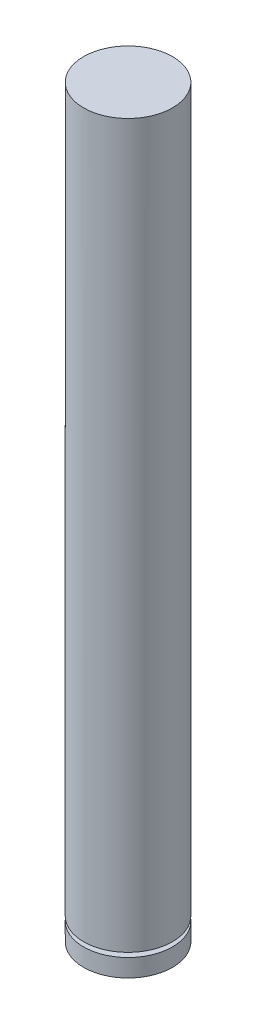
ISO-10303-21;
HEADER;
FILE_DESCRIPTION(('STEP AP214'),'2;1');
FILE_NAME('part.step','',(''),(''),'','','');
FILE_SCHEMA(('AUTOMOTIVE_DESIGN { 1 0 10303 214 1 1 1 1 }'));
ENDSEC;
DATA;
#1=APPLICATION_CONTEXT('core data for automotive mechanical design processes');
#2=APPLICATION_PROTOCOL_DEFINITION('international standard','automotive_design',2000,#1);
#3=PRODUCT_CONTEXT('',#1,'mechanical');
#4=PRODUCT('Part','Part','',(#3));
#5=PRODUCT_RELATED_PRODUCT_CATEGORY('part','',(#4));
#6=PRODUCT_DEFINITION_FORMATION('','',#4);
#7=PRODUCT_DEFINITION_CONTEXT('part definition',#1,'design');
#8=PRODUCT_DEFINITION('design','',#6,#7);
#9=PRODUCT_DEFINITION_SHAPE('','',#8);
#10=(LENGTH_UNIT() NAMED_UNIT(*) SI_UNIT(.MILLI.,.METRE.));
#11=(NAMED_UNIT(*) PLANE_ANGLE_UNIT() SI_UNIT($,.RADIAN.));
#12=(NAMED_UNIT(*) SI_UNIT($,.STERADIAN.) SOLID_ANGLE_UNIT());
#13=UNCERTAINTY_MEASURE_WITH_UNIT(LENGTH_MEASURE(1.E-05),#10,'distance_accuracy_value','');
#14=(GEOMETRIC_REPRESENTATION_CONTEXT(3) GLOBAL_UNCERTAINTY_ASSIGNED_CONTEXT((#13)) GLOBAL_UNIT_ASSIGNED_CONTEXT((#10,
#11,#12)) REPRESENTATION_CONTEXT('',''));
#15=CARTESIAN_POINT('',(0.,0.,0.));
#16=DIRECTION('',(0.,0.,1.));
#17=DIRECTION('',(1.,0.,0.));
#18=AXIS2_PLACEMENT_3D('',#15,#16,#17);
#19=CARTESIAN_POINT('',(0.,33.5,0.));
#20=DIRECTION('',(0.,-1.,0.));
#21=DIRECTION('',(0.,0.,-1.));
#22=AXIS2_PLACEMENT_3D('',#19,#20,#21);
#23=CYLINDRICAL_SURFACE('',#22,2.);
#24=CARTESIAN_POINT('',(0.,0.,0.));
#25=DIRECTION('',(0.,1.,0.));
#26=DIRECTION('',(0.,0.,1.));
#27=AXIS2_PLACEMENT_3D('',#24,#25,#26);
#28=CIRCLE('',#27,2.);
#29=CARTESIAN_POINT('',(0.,0.,2.));
#30=VERTEX_POINT('',#29);
#31=EDGE_CURVE('E37',#30,#30,#28,.T.);
#32=ORIENTED_EDGE('',*,*,#31,.T.);
#33=EDGE_LOOP('',(#32));
#34=FACE_BOUND('',#33,.T.);
#35=CARTESIAN_POINT('',(0.,0.799999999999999,0.));
#36=DIRECTION('',(0.,-1.,0.));
#37=DIRECTION('',(0.,0.,-1.));
#38=AXIS2_PLACEMENT_3D('',#35,#36,#37);
#39=CIRCLE('',#38,2.);
#40=CARTESIAN_POINT('',(0.,0.799999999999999,-2.));
#41=VERTEX_POINT('',#40);
#42=EDGE_CURVE('E48',#41,#41,#39,.T.);
#43=ORIENTED_EDGE('',*,*,#42,.T.);
#44=EDGE_LOOP('',(#43));
#45=FACE_BOUND('',#44,.T.);
#46=ADVANCED_FACE('F33',(#34,#45),#23,.T.);
#47=CARTESIAN_POINT('',(0.,0.,0.));
#48=DIRECTION('',(0.,1.,0.));
#49=DIRECTION('',(0.,0.,1.));
#50=AXIS2_PLACEMENT_3D('',#47,#48,#49);
#51=PLANE('',#50);
#52=ORIENTED_EDGE('',*,*,#31,.F.);
#53=EDGE_LOOP('',(#52));
#54=FACE_BOUND('',#53,.T.);
#55=ADVANCED_FACE('F76',(#54),#51,.F.);
#56=CARTESIAN_POINT('',(0.,-1.7,0.));
#57=DIRECTION('',(0.,-1.,0.));
#58=DIRECTION('',(0.,0.,-1.));
#59=AXIS2_PLACEMENT_3D('',#56,#57,#58);
#60=CYLINDRICAL_SURFACE('',#59,1.5);
#61=CARTESIAN_POINT('',(0.,1.,0.));
#62=DIRECTION('',(0.,-1.,0.));
#63=DIRECTION('',(0.,0.,-1.));
#64=AXIS2_PLACEMENT_3D('',#61,#62,#63);
#65=CIRCLE('',#64,1.5);
#66=CARTESIAN_POINT('',(0.,1.,-1.5));
#67=VERTEX_POINT('',#66);
#68=EDGE_CURVE('E54',#67,#67,#65,.T.);
#69=ORIENTED_EDGE('',*,*,#68,.T.);
#70=EDGE_LOOP('',(#69));
#71=FACE_BOUND('',#70,.T.);
#72=CARTESIAN_POINT('',(0.,0.8,0.));
#73=DIRECTION('',(0.,-1.,0.));
#74=DIRECTION('',(0.,0.,-1.));
#75=AXIS2_PLACEMENT_3D('',#72,#73,#74);
#76=CIRCLE('',#75,1.5);
#77=CARTESIAN_POINT('',(0.,0.8,-1.5));
#78=VERTEX_POINT('',#77);
#79=EDGE_CURVE('E44',#78,#78,#76,.T.);
#80=ORIENTED_EDGE('',*,*,#79,.F.);
#81=EDGE_LOOP('',(#80));
#82=FACE_BOUND('',#81,.T.);
#83=ADVANCED_FACE('F58',(#71,#82),#60,.T.);
#84=CARTESIAN_POINT('',(0.,0.8,0.));
#85=DIRECTION('',(0.,1.,0.));
#86=DIRECTION('',(0.,0.,1.));
#87=AXIS2_PLACEMENT_3D('',#84,#85,#86);
#88=PLANE('',#87);
#89=ORIENTED_EDGE('',*,*,#79,.T.);
#90=EDGE_LOOP('',(#89));
#91=FACE_BOUND('',#90,.T.);
#92=ORIENTED_EDGE('',*,*,#42,.F.);
#93=EDGE_LOOP('',(#92));
#94=FACE_BOUND('',#93,.T.);
#95=ADVANCED_FACE('F65',(#91,#94),#88,.T.);
#96=CARTESIAN_POINT('',(0.,1.,0.));
#97=DIRECTION('',(0.,1.,0.));
#98=DIRECTION('',(0.,0.,1.));
#99=AXIS2_PLACEMENT_3D('',#96,#97,#98);
#100=PLANE('',#99);
#101=ORIENTED_EDGE('',*,*,#68,.F.);
#102=EDGE_LOOP('',(#101));
#103=FACE_BOUND('',#102,.T.);
#104=CARTESIAN_POINT('',(0.,1.,0.));
#105=DIRECTION('',(0.,-1.,0.));
#106=DIRECTION('',(0.,0.,-1.));
#107=AXIS2_PLACEMENT_3D('',#104,#105,#106);
#108=CIRCLE('',#107,2.);
#109=CARTESIAN_POINT('',(0.,1.,-2.));
#110=VERTEX_POINT('',#109);
#111=EDGE_CURVE('E51',#110,#110,#108,.T.);
#112=ORIENTED_EDGE('',*,*,#111,.T.);
#113=EDGE_LOOP('',(#112));
#114=FACE_BOUND('',#113,.T.);
#115=ADVANCED_FACE('F61',(#103,#114),#100,.F.);
#116=CARTESIAN_POINT('',(0.,33.5,0.));
#117=DIRECTION('',(0.,1.,0.));
#118=DIRECTION('',(0.,0.,1.));
#119=AXIS2_PLACEMENT_3D('',#116,#117,#118);
#120=PLANE('',#119);
#121=CARTESIAN_POINT('',(0.,33.5,0.));
#122=DIRECTION('',(0.,1.,0.));
#123=DIRECTION('',(0.,0.,1.));
#124=AXIS2_PLACEMENT_3D('',#121,#122,#123);
#125=CIRCLE('',#124,2.);
#126=CARTESIAN_POINT('',(0.,33.5,2.));
#127=VERTEX_POINT('',#126);
#128=EDGE_CURVE('E10',#127,#127,#125,.T.);
#129=ORIENTED_EDGE('',*,*,#128,.T.);
#130=EDGE_LOOP('',(#129));
#131=FACE_BOUND('',#130,.T.);
#132=ADVANCED_FACE('F64',(#131),#120,.T.);
#133=ORIENTED_EDGE('',*,*,#111,.F.);
#134=EDGE_LOOP('',(#133));
#135=FACE_BOUND('',#134,.T.);
#136=ORIENTED_EDGE('',*,*,#128,.F.);
#137=EDGE_LOOP('',(#136));
#138=FACE_BOUND('',#137,.T.);
#139=ADVANCED_FACE('F35',(#135,#138),#23,.T.);
#140=CLOSED_SHELL('',(#46,#55,#83,#95,#115,#132,#139));
#141=MANIFOLD_SOLID_BREP('B2',#140);
#142=ADVANCED_BREP_SHAPE_REPRESENTATION('',(#18,#141),#14);
#143=SHAPE_DEFINITION_REPRESENTATION(#9,#142);
ENDSEC;
END-ISO-10303-21;
